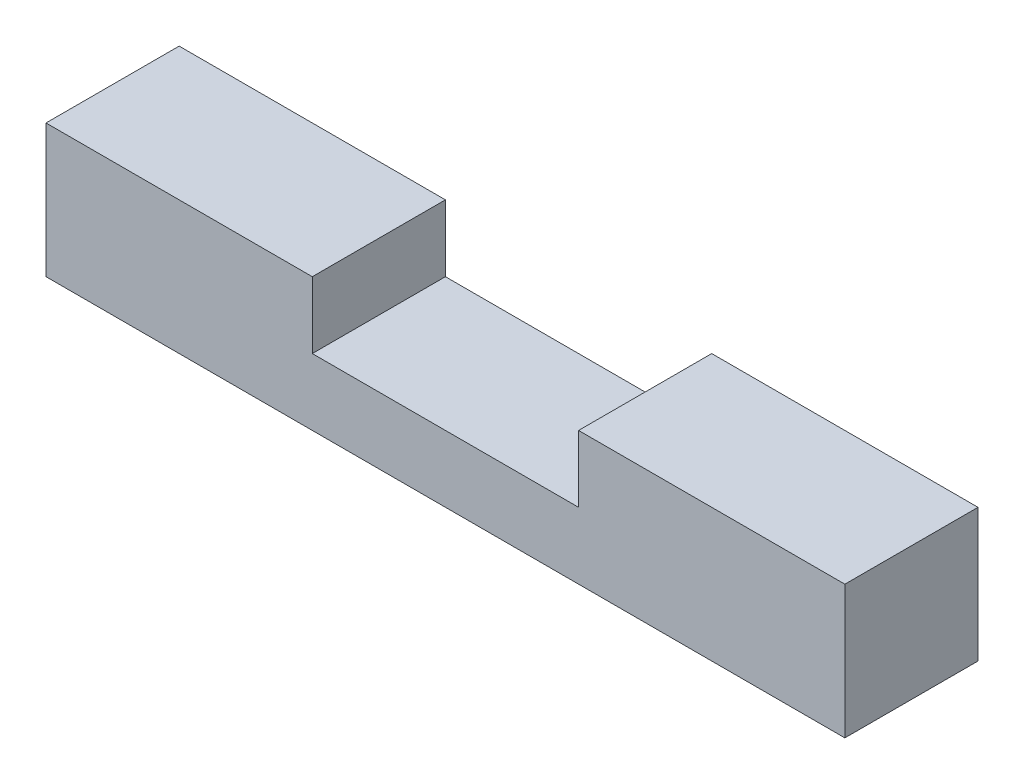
from build123d import *

# Parameters (mm, degrees)
SKETCH1_W      = 120
SKETCH1_H      = 20
EXTRUDE1_DEPTH = 20
SKETCH2_W      = 40
SKETCH2_H      = 10
EXTRUDE2_DEPTH = 124.288280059


with BuildPart() as part:
    # Sketch1 → Extrude1 (new body)
    with BuildSketch(Plane(origin=(0, 0, 0), x_dir=(1, 0, 0), z_dir=(0, 1, 0))):
        with Locations((60, 10)):
            Rectangle(SKETCH1_W, SKETCH1_H)
    extrude(amount=EXTRUDE1_DEPTH)

    # Sketch2 → Extrude2 (cut, through all)
    with BuildSketch(Plane.XY):
        with Locations((60, 15)):
            Rectangle(SKETCH2_W, SKETCH2_H)
    extrude(amount=-EXTRUDE2_DEPTH, mode=Mode.SUBTRACT)


solid = part.part
